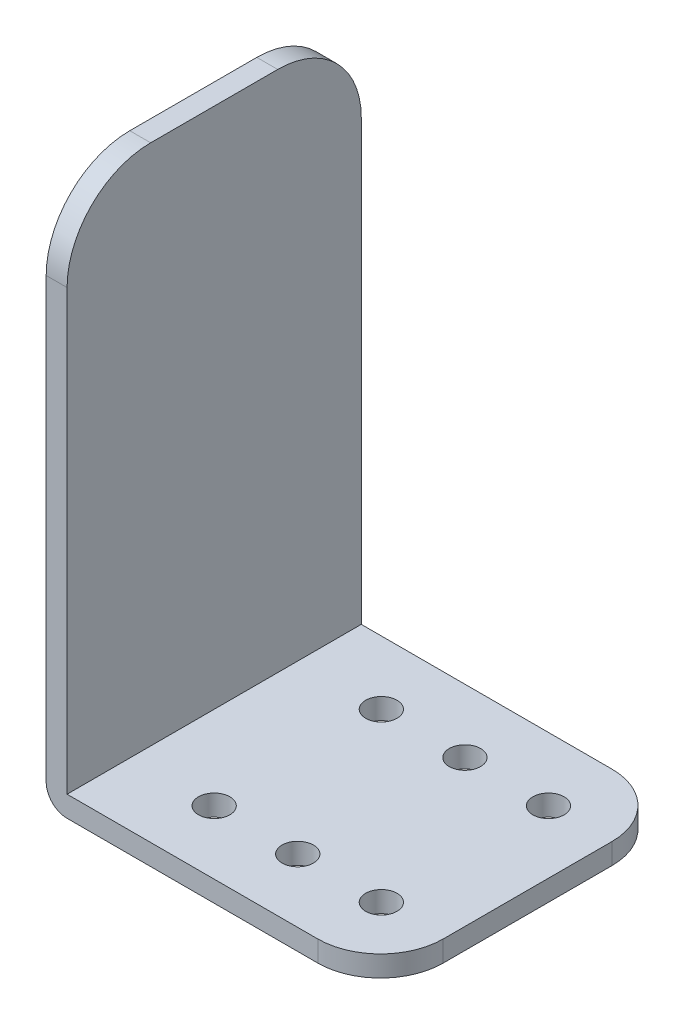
from build123d import *

# Parameters (mm, degrees)
BOSS_EXTRUDE2_DEPTH = 171.45
SKETCH3_W           = 82.042
SKETCH3_H           = 9.525
CUT_EXTRUDE1_DEPTH  = 197.952392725
CUT_EXTRUDE2_REACH  = 197.643
SKETCH4_R           = 2.38125
FILLET1_R           = 9.525
FILLET2_R           = 3.175
FILLET3_R           = 12.7
CUT_EXTRUDE4_REACH  = 198.952
SKETCH5_W           = 50.8
SKETCH5_H           = 126.746
FILLET4_R           = 12.7


with BuildPart() as part:
    # Sketch2 → Boss-Extrude2 (new body)
    with BuildSketch(Plane.XY):
        Polygon((0, 0), (0, -82.55), (50.8, -82.55), (50.8, -79.375), (3.175, -79.375), (3.175, 0), align=None)
    extrude(amount=BOSS_EXTRUDE2_DEPTH)

    # Sketch3 → Cut-Extrude1 (cut, through all)
    with BuildSketch(Plane.ZY):
        with Locations((85.725, -77.7875)):
            Rectangle(SKETCH3_W, SKETCH3_H)
    extrude(amount=-CUT_EXTRUDE1_DEPTH, mode=Mode.SUBTRACT)

    # Sketch4 → Cut-Extrude2 (cut, up to next)
    with BuildSketch(Plane(origin=(0, -79.375, 0), x_dir=(1, 0, 0), z_dir=(0, 1, 0)), mode=Mode.PRIVATE) as cut_extrude2_sk1:
        with Locations(Location((15.875, -161.798, 0), (0, 0, 270))):
            Circle(SKETCH4_R)
    cut_extrude2_tool1 = extrude(cut_extrude2_sk1.sketch, amount=-CUT_EXTRUDE2_REACH, mode=Mode.PRIVATE) & part.part
    # Sketch4 → Cut-Extrude2 (cut, up to next)
    with BuildSketch(Plane(origin=(0, -79.375, 0), x_dir=(1, 0, 0), z_dir=(0, 1, 0)), mode=Mode.PRIVATE) as cut_extrude2_sk2:
        with Locations(Location((28.575, -161.798, 0), (0, 0, 270))):
            Circle(SKETCH4_R)
    cut_extrude2_tool2 = extrude(cut_extrude2_sk2.sketch, amount=-CUT_EXTRUDE2_REACH, mode=Mode.PRIVATE) & part.part
    # Sketch4 → Cut-Extrude2 (cut, up to next)
    with BuildSketch(Plane(origin=(0, -79.375, 0), x_dir=(1, 0, 0), z_dir=(0, 1, 0)), mode=Mode.PRIVATE) as cut_extrude2_sk3:
        with Locations(Location((41.275, -161.798, 0), (0, 0, 270))):
            Circle(SKETCH4_R)
    cut_extrude2_tool3 = extrude(cut_extrude2_sk3.sketch, amount=-CUT_EXTRUDE2_REACH, mode=Mode.PRIVATE) & part.part
    # Sketch4 → Cut-Extrude2 (cut, up to next)
    with BuildSketch(Plane(origin=(0, -79.375, 0), x_dir=(1, 0, 0), z_dir=(0, 1, 0)), mode=Mode.PRIVATE) as cut_extrude2_sk4:
        with Locations(Location((15.875, -136.398, 0), (0, 0, 270))):
            Circle(SKETCH4_R)
    cut_extrude2_tool4 = extrude(cut_extrude2_sk4.sketch, amount=-CUT_EXTRUDE2_REACH, mode=Mode.PRIVATE) & part.part
    # Sketch4 → Cut-Extrude2 (cut, up to next)
    with BuildSketch(Plane(origin=(0, -79.375, 0), x_dir=(1, 0, 0), z_dir=(0, 1, 0)), mode=Mode.PRIVATE) as cut_extrude2_sk5:
        with Locations(Location((28.575, -136.398, 0), (0, 0, 270))):
            Circle(SKETCH4_R)
    cut_extrude2_tool5 = extrude(cut_extrude2_sk5.sketch, amount=-CUT_EXTRUDE2_REACH, mode=Mode.PRIVATE) & part.part
    # Sketch4 → Cut-Extrude2 (cut, up to next)
    with BuildSketch(Plane(origin=(0, -79.375, 0), x_dir=(1, 0, 0), z_dir=(0, 1, 0)), mode=Mode.PRIVATE) as cut_extrude2_sk6:
        with Locations(Location((41.275, -136.398, 0), (0, 0, 270))):
            Circle(SKETCH4_R)
    cut_extrude2_tool6 = extrude(cut_extrude2_sk6.sketch, amount=-CUT_EXTRUDE2_REACH, mode=Mode.PRIVATE) & part.part
    # Sketch4 → Cut-Extrude2 (cut, up to next)
    with BuildSketch(Plane(origin=(0, -79.375, 0), x_dir=(1, 0, 0), z_dir=(0, 1, 0)), mode=Mode.PRIVATE) as cut_extrude2_sk7:
        with Locations(Location((41.275, -35.052, 0), (0, 0, 270))):
            Circle(SKETCH4_R)
    cut_extrude2_tool7 = extrude(cut_extrude2_sk7.sketch, amount=-CUT_EXTRUDE2_REACH, mode=Mode.PRIVATE) & part.part
    # Sketch4 → Cut-Extrude2 (cut, up to next)
    with BuildSketch(Plane(origin=(0, -79.375, 0), x_dir=(1, 0, 0), z_dir=(0, 1, 0)), mode=Mode.PRIVATE) as cut_extrude2_sk8:
        with Locations(Location((28.575, -35.052, 0), (0, 0, 270))):
            Circle(SKETCH4_R)
    cut_extrude2_tool8 = extrude(cut_extrude2_sk8.sketch, amount=-CUT_EXTRUDE2_REACH, mode=Mode.PRIVATE) & part.part
    # Sketch4 → Cut-Extrude2 (cut, up to next)
    with BuildSketch(Plane(origin=(0, -79.375, 0), x_dir=(1, 0, 0), z_dir=(0, 1, 0)), mode=Mode.PRIVATE) as cut_extrude2_sk9:
        with Locations(Location((15.875, -35.052, 0), (0, 0, 270))):
            Circle(SKETCH4_R)
    cut_extrude2_tool9 = extrude(cut_extrude2_sk9.sketch, amount=-CUT_EXTRUDE2_REACH, mode=Mode.PRIVATE) & part.part
    # Sketch4 → Cut-Extrude2 (cut, up to next)
    with BuildSketch(Plane(origin=(0, -79.375, 0), x_dir=(1, 0, 0), z_dir=(0, 1, 0)), mode=Mode.PRIVATE) as cut_extrude2_sk10:
        with Locations(Location((41.275, -9.652, 0), (0, 0, 270))):
            Circle(SKETCH4_R)
    cut_extrude2_tool10 = extrude(cut_extrude2_sk10.sketch, amount=-CUT_EXTRUDE2_REACH, mode=Mode.PRIVATE) & part.part
    # Sketch4 → Cut-Extrude2 (cut, up to next)
    with BuildSketch(Plane(origin=(0, -79.375, 0), x_dir=(1, 0, 0), z_dir=(0, 1, 0)), mode=Mode.PRIVATE) as cut_extrude2_sk11:
        with Locations(Location((28.575, -9.652, 0), (0, 0, 270))):
            Circle(SKETCH4_R)
    cut_extrude2_tool11 = extrude(cut_extrude2_sk11.sketch, amount=-CUT_EXTRUDE2_REACH, mode=Mode.PRIVATE) & part.part
    # Sketch4 → Cut-Extrude2 (cut, up to next)
    with BuildSketch(Plane(origin=(0, -79.375, 0), x_dir=(1, 0, 0), z_dir=(0, 1, 0)), mode=Mode.PRIVATE) as cut_extrude2_sk12:
        with Locations(Location((15.875, -9.652, 0), (0, 0, 270))):
            Circle(SKETCH4_R)
    cut_extrude2_tool12 = extrude(cut_extrude2_sk12.sketch, amount=-CUT_EXTRUDE2_REACH, mode=Mode.PRIVATE) & part.part
    add(cut_extrude2_tool1.solids().sort_by_distance((15.875, -79.375, 161.798))[0], mode=Mode.SUBTRACT)
    add(cut_extrude2_tool2.solids().sort_by_distance((28.575, -79.375, 161.798))[0], mode=Mode.SUBTRACT)
    add(cut_extrude2_tool3.solids().sort_by_distance((41.275, -79.375, 161.798))[0], mode=Mode.SUBTRACT)
    add(cut_extrude2_tool4.solids().sort_by_distance((15.875, -79.375, 136.398))[0], mode=Mode.SUBTRACT)
    add(cut_extrude2_tool5.solids().sort_by_distance((28.575, -79.375, 136.398))[0], mode=Mode.SUBTRACT)
    add(cut_extrude2_tool6.solids().sort_by_distance((41.275, -79.375, 136.398))[0], mode=Mode.SUBTRACT)
    add(cut_extrude2_tool7.solids().sort_by_distance((41.275, -79.375, 35.052))[0], mode=Mode.SUBTRACT)
    add(cut_extrude2_tool8.solids().sort_by_distance((28.575, -79.375, 35.052))[0], mode=Mode.SUBTRACT)
    add(cut_extrude2_tool9.solids().sort_by_distance((15.875, -79.375, 35.052))[0], mode=Mode.SUBTRACT)
    add(cut_extrude2_tool10.solids().sort_by_distance((41.275, -79.375, 9.652))[0], mode=Mode.SUBTRACT)
    add(cut_extrude2_tool11.solids().sort_by_distance((28.575, -79.375, 9.652))[0], mode=Mode.SUBTRACT)
    add(cut_extrude2_tool12.solids().sort_by_distance((15.875, -79.375, 9.652))[0], mode=Mode.SUBTRACT)

    # Fillet1
    fillet1_edges = [part.edges().sort_by_distance(p)[0] for p in [
        (50.8, -80.9625, 171.45),
        (50.8, -80.9625, 126.746),
        (50.8, -80.9625, 44.704),
        (50.8, -80.9625, 0),
    ]]
    fillet(fillet1_edges, radius=FILLET1_R)

    # Fillet2
    fillet2_edges = [part.edges().sort_by_distance(p)[0] for p in [
        (0, -82.55, 149.098),
        (0, -82.55, 22.352),
    ]]
    fillet(fillet2_edges, radius=FILLET2_R)

    # Fillet3
    fillet3_edges = [part.edges().sort_by_distance(p)[0] for p in [
        (1.5875, 0, 171.45),
        (1.5875, 0, 0),
    ]]
    fillet(fillet3_edges, radius=FILLET3_R)

    # Sketch5 → Cut-Extrude4 (cut, up to next)
    with BuildSketch(Plane(origin=(0, 0, 0), x_dir=(1, 0, 0), z_dir=(0, 1, 0)), mode=Mode.PRIVATE) as cut_extrude4_sk1:
        with Locations((25.4, -63.373)):
            Rectangle(SKETCH5_W, SKETCH5_H)
    cut_extrude4_tool1 = extrude(cut_extrude4_sk1.sketch, amount=-CUT_EXTRUDE4_REACH, mode=Mode.PRIVATE) & part.part
    add(cut_extrude4_tool1.solids().sort_by_distance((25.4, 0, 63.373))[0], mode=Mode.SUBTRACT)

    # Fillet4
    fillet4_edges = [part.edges().sort_by_distance(p)[0] for p in [
        (1.5875, 0, 126.746),
    ]]
    fillet(fillet4_edges, radius=FILLET4_R)


solid = part.part
